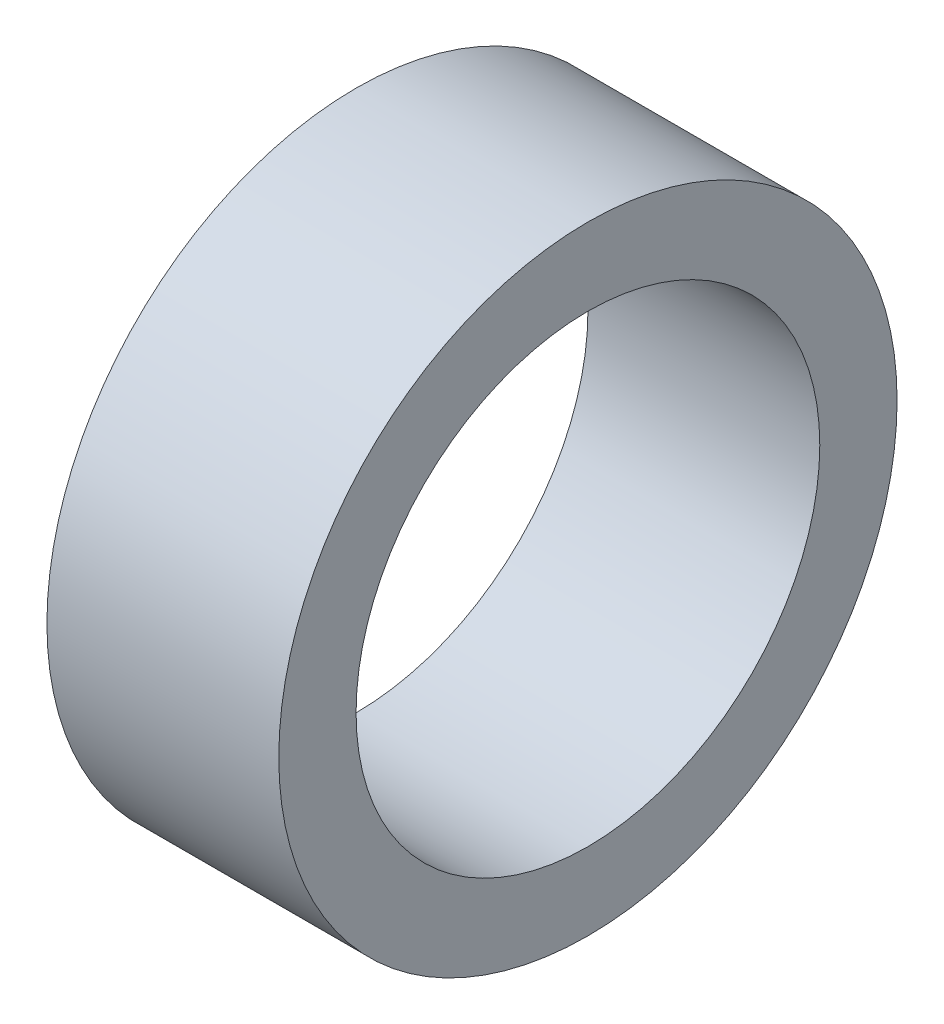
ISO-10303-21;
HEADER;
FILE_DESCRIPTION(('STEP AP214'),'2;1');
FILE_NAME('part.step','',(''),(''),'','','');
FILE_SCHEMA(('AUTOMOTIVE_DESIGN { 1 0 10303 214 1 1 1 1 }'));
ENDSEC;
DATA;
#1=APPLICATION_CONTEXT('core data for automotive mechanical design processes');
#2=APPLICATION_PROTOCOL_DEFINITION('international standard','automotive_design',2000,#1);
#3=PRODUCT_CONTEXT('',#1,'mechanical');
#4=PRODUCT('Part','Part','',(#3));
#5=PRODUCT_RELATED_PRODUCT_CATEGORY('part','',(#4));
#6=PRODUCT_DEFINITION_FORMATION('','',#4);
#7=PRODUCT_DEFINITION_CONTEXT('part definition',#1,'design');
#8=PRODUCT_DEFINITION('design','',#6,#7);
#9=PRODUCT_DEFINITION_SHAPE('','',#8);
#10=(LENGTH_UNIT() NAMED_UNIT(*) SI_UNIT(.MILLI.,.METRE.));
#11=(NAMED_UNIT(*) PLANE_ANGLE_UNIT() SI_UNIT($,.RADIAN.));
#12=(NAMED_UNIT(*) SI_UNIT($,.STERADIAN.) SOLID_ANGLE_UNIT());
#13=UNCERTAINTY_MEASURE_WITH_UNIT(LENGTH_MEASURE(1.E-05),#10,'distance_accuracy_value','');
#14=(GEOMETRIC_REPRESENTATION_CONTEXT(3) GLOBAL_UNCERTAINTY_ASSIGNED_CONTEXT((#13)) GLOBAL_UNIT_ASSIGNED_CONTEXT((#10,
#11,#12)) REPRESENTATION_CONTEXT('',''));
#15=CARTESIAN_POINT('',(0.,0.,0.));
#16=DIRECTION('',(0.,0.,1.));
#17=DIRECTION('',(1.,0.,0.));
#18=AXIS2_PLACEMENT_3D('',#15,#16,#17);
#19=CARTESIAN_POINT('',(15.,0.,0.));
#20=DIRECTION('',(1.,0.,0.));
#21=DIRECTION('',(0.,0.,-1.));
#22=AXIS2_PLACEMENT_3D('',#19,#20,#21);
#23=PLANE('',#22);
#24=CARTESIAN_POINT('',(15.,0.,0.));
#25=DIRECTION('',(1.,0.,0.));
#26=DIRECTION('',(0.,0.,-1.));
#27=AXIS2_PLACEMENT_3D('',#24,#25,#26);
#28=CIRCLE('',#27,20.);
#29=CARTESIAN_POINT('',(15.,0.,-20.));
#30=VERTEX_POINT('',#29);
#31=EDGE_CURVE('E10',#30,#30,#28,.T.);
#32=ORIENTED_EDGE('',*,*,#31,.T.);
#33=EDGE_LOOP('',(#32));
#34=FACE_BOUND('',#33,.T.);
#35=CARTESIAN_POINT('',(15.,0.,0.));
#36=DIRECTION('',(1.,0.,0.));
#37=DIRECTION('',(0.,0.,-1.));
#38=AXIS2_PLACEMENT_3D('',#35,#36,#37);
#39=CIRCLE('',#38,15.);
#40=CARTESIAN_POINT('',(15.,0.,-15.));
#41=VERTEX_POINT('',#40);
#42=EDGE_CURVE('E44',#41,#41,#39,.T.);
#43=ORIENTED_EDGE('',*,*,#42,.F.);
#44=EDGE_LOOP('',(#43));
#45=FACE_BOUND('',#44,.T.);
#46=ADVANCED_FACE('F33',(#34,#45),#23,.T.);
#47=CARTESIAN_POINT('',(0.,0.,0.));
#48=DIRECTION('',(1.,0.,0.));
#49=DIRECTION('',(0.,0.,-1.));
#50=AXIS2_PLACEMENT_3D('',#47,#48,#49);
#51=PLANE('',#50);
#52=CARTESIAN_POINT('',(0.,0.,0.));
#53=DIRECTION('',(1.,0.,0.));
#54=DIRECTION('',(0.,0.,-1.));
#55=AXIS2_PLACEMENT_3D('',#52,#53,#54);
#56=CIRCLE('',#55,20.);
#57=CARTESIAN_POINT('',(0.,0.,-20.));
#58=VERTEX_POINT('',#57);
#59=EDGE_CURVE('E37',#58,#58,#56,.T.);
#60=ORIENTED_EDGE('',*,*,#59,.F.);
#61=EDGE_LOOP('',(#60));
#62=FACE_BOUND('',#61,.T.);
#63=CARTESIAN_POINT('',(0.,0.,0.));
#64=DIRECTION('',(1.,0.,0.));
#65=DIRECTION('',(0.,0.,-1.));
#66=AXIS2_PLACEMENT_3D('',#63,#64,#65);
#67=CIRCLE('',#66,15.);
#68=CARTESIAN_POINT('',(0.,0.,-15.));
#69=VERTEX_POINT('',#68);
#70=EDGE_CURVE('E46',#69,#69,#67,.T.);
#71=ORIENTED_EDGE('',*,*,#70,.T.);
#72=EDGE_LOOP('',(#71));
#73=FACE_BOUND('',#72,.T.);
#74=ADVANCED_FACE('F56',(#62,#73),#51,.F.);
#75=CARTESIAN_POINT('',(15.,0.,0.));
#76=DIRECTION('',(-1.,0.,0.));
#77=DIRECTION('',(0.,0.,1.));
#78=AXIS2_PLACEMENT_3D('',#75,#76,#77);
#79=CYLINDRICAL_SURFACE('',#78,20.);
#80=ORIENTED_EDGE('',*,*,#31,.F.);
#81=EDGE_LOOP('',(#80));
#82=FACE_BOUND('',#81,.T.);
#83=ORIENTED_EDGE('',*,*,#59,.T.);
#84=EDGE_LOOP('',(#83));
#85=FACE_BOUND('',#84,.T.);
#86=ADVANCED_FACE('F35',(#82,#85),#79,.T.);
#87=CARTESIAN_POINT('',(15.,0.,0.));
#88=DIRECTION('',(-1.,0.,0.));
#89=DIRECTION('',(0.,0.,1.));
#90=AXIS2_PLACEMENT_3D('',#87,#88,#89);
#91=CYLINDRICAL_SURFACE('',#90,15.);
#92=ORIENTED_EDGE('',*,*,#42,.T.);
#93=EDGE_LOOP('',(#92));
#94=FACE_BOUND('',#93,.T.);
#95=ORIENTED_EDGE('',*,*,#70,.F.);
#96=EDGE_LOOP('',(#95));
#97=FACE_BOUND('',#96,.T.);
#98=ADVANCED_FACE('F52',(#94,#97),#91,.F.);
#99=CLOSED_SHELL('',(#46,#74,#86,#98));
#100=MANIFOLD_SOLID_BREP('B2',#99);
#101=ADVANCED_BREP_SHAPE_REPRESENTATION('',(#18,#100),#14);
#102=SHAPE_DEFINITION_REPRESENTATION(#9,#101);
ENDSEC;
END-ISO-10303-21;
